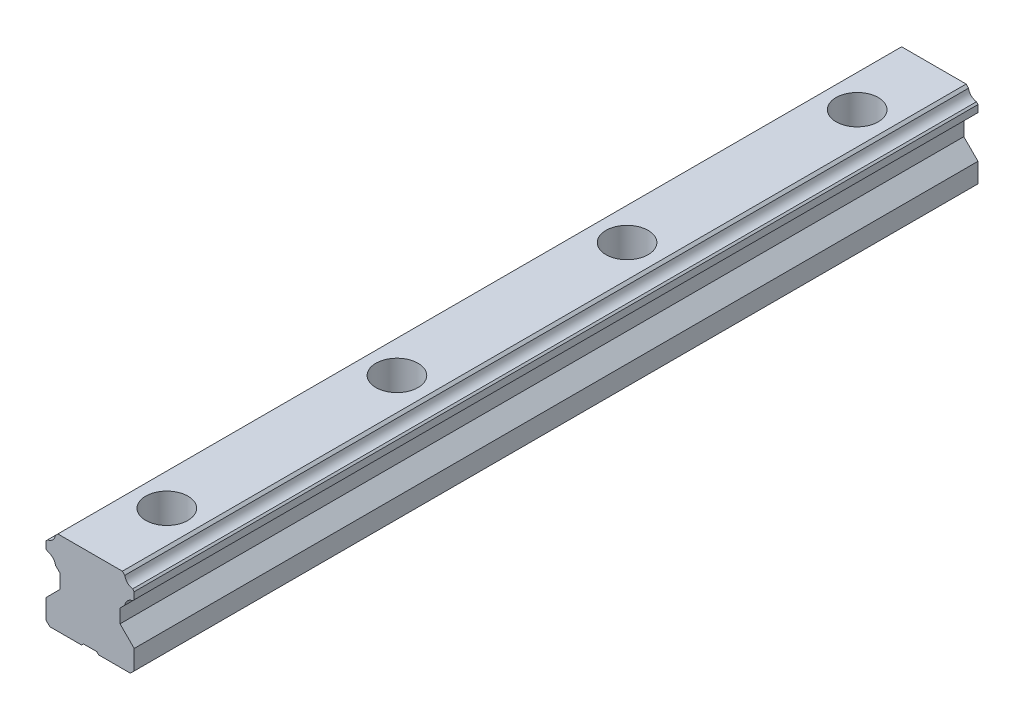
from build123d import *

# Parameters (mm, degrees)
BOSS_EXTRUDE1_DEPTH                                 = 110
CBORE_FOR_M4_HEX_SOCKET_HEAD_CAP_SCREW1_D           = 7
CBORE_FOR_M4_HEX_SOCKET_HEAD_CAP_SCREW1_CBORE_D     = 11
CBORE_FOR_M4_HEX_SOCKET_HEAD_CAP_SCREW1_CBORE_DEPTH = 9
LPATTERN1_COUNT                                     = 4
LPATTERN1_PITCH                                     = 60


with BuildPart() as part:
    # Sketch1 → Boss-Extrude1 (new, symmetric)
    with BuildSketch(Plane.XY):
        with BuildLine():
            Line((-9.035666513, 21.374606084), (-8.410271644, 22))
            Line((-8.410271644, 22), (8.410271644, 22))
            Line((8.410271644, 22), (9.035666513, 21.374606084))
            ThreePointArc((9.035666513, 21.374606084), (9.729041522, 20.024207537), (11.07944007, 19.330832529))
            Line((11.07944007, 19.330832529), (11.5, 18.910271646))
            Line((11.5, 18.910271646), (11.5, 17.079302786))
            Line((11.5, 17.079302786), (11.091594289, 16.67089517))
            ThreePointArc((11.091594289, 16.67089517), (9.729041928, 15.975548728), (9.033694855, 14.612996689))
            Line((9.033694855, 14.612996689), (7.800048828, 13.379350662))
            Line((7.800048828, 13.379350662), (7.800048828, 9.800170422))
            Line((7.800048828, 9.800170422), (11.5, 6.10021925))
            Line((11.5, 6.10021925), (11.5, 1))
            Line((11.5, 1), (10.5, 0))
            Line((10.5, 0), (2.25, 0))
            Line((2.25, 0), (1.75, 0.5))
            Line((1.75, 0.5), (-1.75, 0.5))
            Line((-1.75, 0.5), (-2.25, 0))
            Line((-2.25, 0), (-10.5, 0))
            Line((-10.5, 0), (-11.5, 1))
            Line((-11.5, 1), (-11.5, 6.10021925))
            Line((-11.5, 6.10021925), (-7.800048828, 9.800170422))
            Line((-7.800048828, 9.800170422), (-7.800048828, 13.379350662))
            Line((-7.800048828, 13.379350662), (-9.033694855, 14.612996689))
            ThreePointArc((-9.033694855, 14.612996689), (-9.729041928, 15.975548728), (-11.091594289, 16.67089517))
            Line((-11.091594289, 16.67089517), (-11.5, 17.079302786))
            Line((-11.5, 17.079302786), (-11.5, 18.910271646))
            Line((-11.5, 18.910271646), (-11.07944007, 19.330832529))
            ThreePointArc((-11.07944007, 19.330832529), (-9.729041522, 20.024207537), (-9.035666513, 21.374606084))
        make_face()
    extrude(amount=BOSS_EXTRUDE1_DEPTH, both=True)

    # CBORE for M4 Hex Socket Head Cap Screw1 (through all)
    with Locations(Plane(origin=(0, 22, 0), x_dir=(1, 0, 0), z_dir=(0, 1, 0))):
        with Locations((0, -90)):
            cbore_for_m4_hex_socket_head_cap_screw1 = CounterBoreHole(CBORE_FOR_M4_HEX_SOCKET_HEAD_CAP_SCREW1_D / 2, CBORE_FOR_M4_HEX_SOCKET_HEAD_CAP_SCREW1_CBORE_D / 2, CBORE_FOR_M4_HEX_SOCKET_HEAD_CAP_SCREW1_CBORE_DEPTH)

    # LPattern1: CBORE for M4 Hex Socket Head Cap Screw1 ×4
    with Locations(*[(0, 0, -i * LPATTERN1_PITCH) for i in range(1, LPATTERN1_COUNT)]):
        add(cbore_for_m4_hex_socket_head_cap_screw1, mode=Mode.SUBTRACT)


solid = part.part
